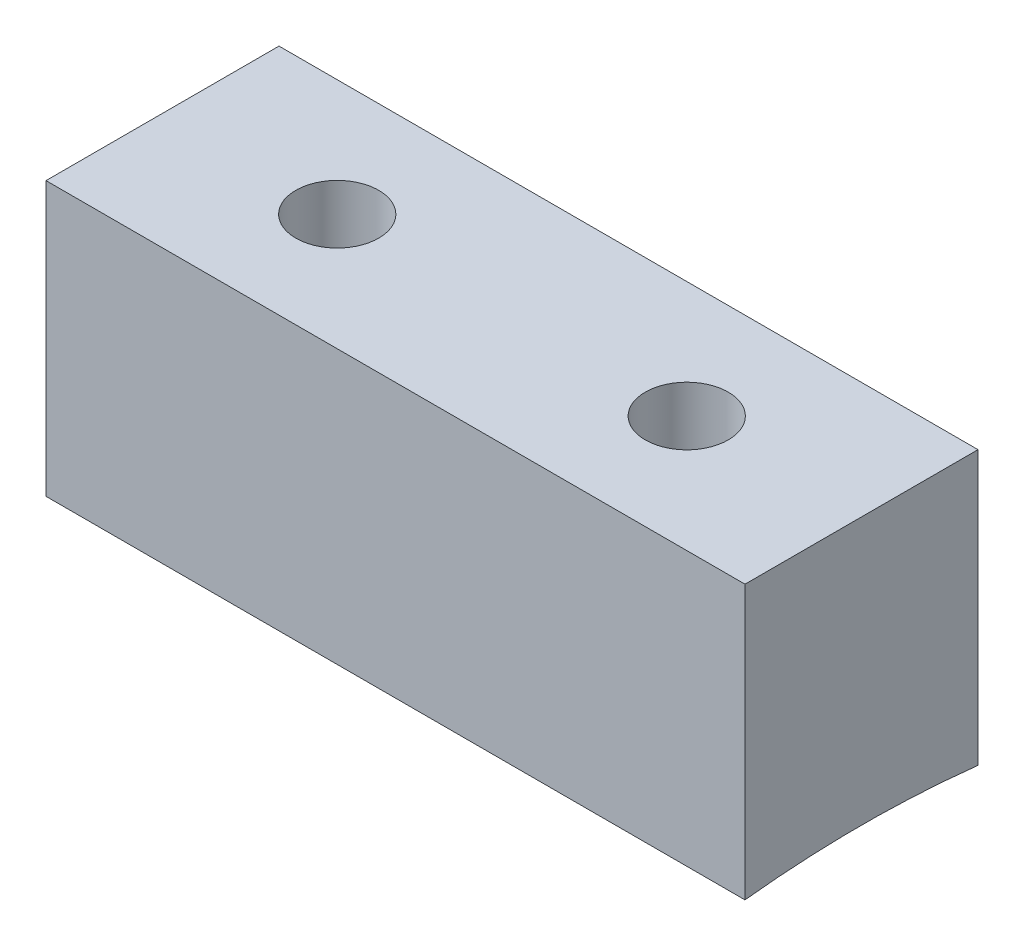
from build123d import *

# Parameters (mm, degrees)
SKETCH1_W             = 19.05
SKETCH1_H             = 7.45236
EXTRUDE1_DEPTH        = 6.35
F_4_40_TAPPED_HOLE1_D = 2.2606
SKETCH2_R             = 28.575
CUT_EXTRUDE1_DEPTH    = 22.418745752


with BuildPart() as part:
    # Sketch1 → Extrude1 (new body)
    with BuildSketch(Plane.XY):
        with Locations((-9.525, 3.72618)):
            Rectangle(SKETCH1_W, SKETCH1_H)
    extrude(amount=EXTRUDE1_DEPTH)

    # 4-40 Tapped Hole1 (through all)
    with Locations(Plane(origin=(-14.2875, 7.45236, 3.175), x_dir=(0, 0, 1), z_dir=(0, 1, 0))):
        with Locations((0, 0), (0, 9.525)):
            Hole(F_4_40_TAPPED_HOLE1_D / 2)

    # Sketch2 → Cut-Extrude1 (cut, through all)
    with BuildSketch(Plane(origin=(0, 0, 0), x_dir=(0, 0, -1), z_dir=(1, 0, 0))):
        with Locations((-3.175, -28.398063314)):
            Circle(SKETCH2_R)
    extrude(amount=-CUT_EXTRUDE1_DEPTH, mode=Mode.SUBTRACT)


solid = part.part
